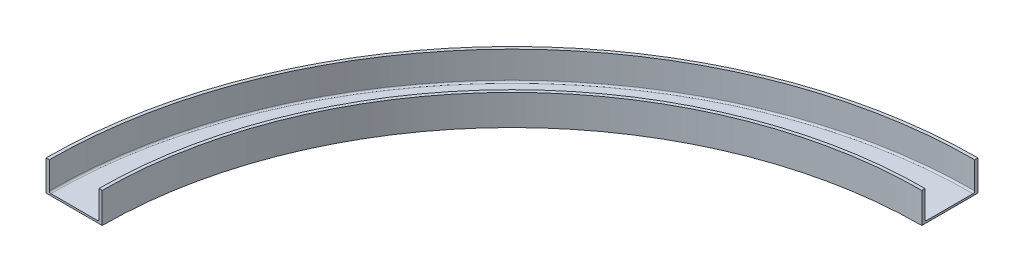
from build123d import *

# Parameters (mm, degrees)
CUT_EXTRUDE4_DEPTH      = 2757.898274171
CUT_EXTRUDE4_DEPTH_BACK = 2757.898274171


with BuildPart() as part:
    # Sweep2: sweep along a path in Sketch9
    with BuildLine(Plane(origin=(0, 0, 0), x_dir=(1, 0, 0), z_dir=(0, 1, 0))) as sweep2_path:
        CenterArc((1186.97, 0), 1254.28, 0, 360)
    # Sketch3 → Sweep2 (sweep)
    with BuildSketch(Plane.XY):
        with BuildLine():
            Line((-76.2, 41.275), (-76.2, -41.275))
            Line((-76.2, -41.275), (76.2, -41.275))
            Line((76.2, -41.275), (76.2, 41.275))
            Line((76.2, 41.275), (67.31, 41.275))
            Line((67.31, 41.275), (67.31, -31.496))
            ThreePointArc((67.31, -31.496), (66.008089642, -34.639089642), (62.865, -35.941))
            Line((62.865, -35.941), (-62.865, -35.941))
            ThreePointArc((-62.865, -35.941), (-66.008089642, -34.639089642), (-67.31, -31.496))
            Line((-67.31, -31.496), (-67.31, 41.275))
            Line((-67.31, 41.275), (-76.2, 41.275))
        make_face()
    sweep(path=sweep2_path.line)

    # Sketch11 → Cut-Extrude4 (cut, two sides: drawn at the far end of the back side and taken through both)
    with BuildSketch(Plane(origin=(0, 0, 0), x_dir=(1, 0, 0), z_dir=(0, 1, 0)).offset(-CUT_EXTRUDE4_DEPTH_BACK)):
        Polygon((-450.887453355, 0), (1186.97, 0), (1186.97, 1939.454626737), (2729.318145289, 1939.454626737), (2729.318145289, -1455.543492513), (-450.887453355, -1455.543492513), align=None)
    extrude(amount=CUT_EXTRUDE4_DEPTH + CUT_EXTRUDE4_DEPTH_BACK, mode=Mode.SUBTRACT)


solid = part.part
